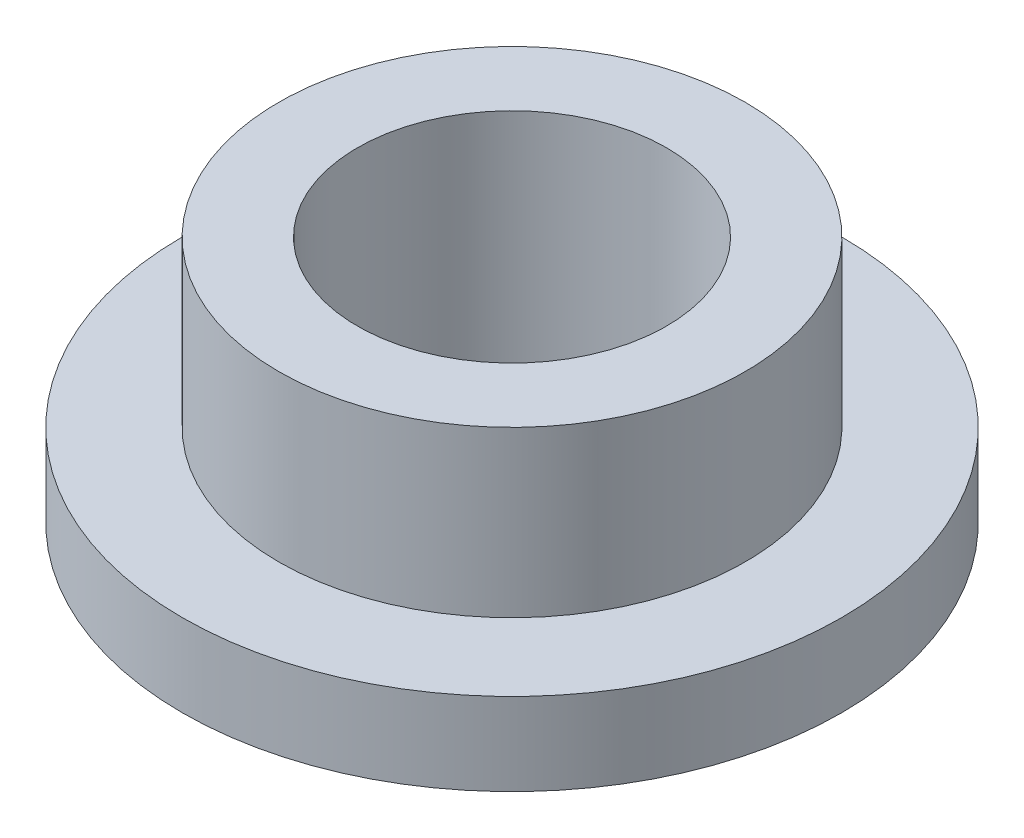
ISO-10303-21;
HEADER;
FILE_DESCRIPTION(('STEP AP214'),'2;1');
FILE_NAME('part.step','',(''),(''),'','','');
FILE_SCHEMA(('AUTOMOTIVE_DESIGN { 1 0 10303 214 1 1 1 1 }'));
ENDSEC;
DATA;
#1=APPLICATION_CONTEXT('core data for automotive mechanical design processes');
#2=APPLICATION_PROTOCOL_DEFINITION('international standard','automotive_design',2000,#1);
#3=PRODUCT_CONTEXT('',#1,'mechanical');
#4=PRODUCT('Part','Part','',(#3));
#5=PRODUCT_RELATED_PRODUCT_CATEGORY('part','',(#4));
#6=PRODUCT_DEFINITION_FORMATION('','',#4);
#7=PRODUCT_DEFINITION_CONTEXT('part definition',#1,'design');
#8=PRODUCT_DEFINITION('design','',#6,#7);
#9=PRODUCT_DEFINITION_SHAPE('','',#8);
#10=(LENGTH_UNIT() NAMED_UNIT(*) SI_UNIT(.MILLI.,.METRE.));
#11=(NAMED_UNIT(*) PLANE_ANGLE_UNIT() SI_UNIT($,.RADIAN.));
#12=(NAMED_UNIT(*) SI_UNIT($,.STERADIAN.) SOLID_ANGLE_UNIT());
#13=UNCERTAINTY_MEASURE_WITH_UNIT(LENGTH_MEASURE(1.E-05),#10,'distance_accuracy_value','');
#14=(GEOMETRIC_REPRESENTATION_CONTEXT(3) GLOBAL_UNCERTAINTY_ASSIGNED_CONTEXT((#13)) GLOBAL_UNIT_ASSIGNED_CONTEXT((#10,
#11,#12)) REPRESENTATION_CONTEXT('',''));
#15=CARTESIAN_POINT('',(0.,0.,0.));
#16=DIRECTION('',(0.,0.,1.));
#17=DIRECTION('',(1.,0.,0.));
#18=AXIS2_PLACEMENT_3D('',#15,#16,#17);
#19=CARTESIAN_POINT('',(0.,0.,0.));
#20=DIRECTION('',(0.,-1.,0.));
#21=DIRECTION('',(0.,0.,-1.));
#22=AXIS2_PLACEMENT_3D('',#19,#20,#21);
#23=CYLINDRICAL_SURFACE('',#22,5.08);
#24=CARTESIAN_POINT('',(0.,1.27,0.));
#25=DIRECTION('',(0.,-1.,0.));
#26=DIRECTION('',(0.,0.,-1.));
#27=AXIS2_PLACEMENT_3D('',#24,#25,#26);
#28=CIRCLE('',#27,5.08);
#29=CARTESIAN_POINT('',(0.,1.27,-5.08));
#30=VERTEX_POINT('',#29);
#31=EDGE_CURVE('E10',#30,#30,#28,.T.);
#32=ORIENTED_EDGE('',*,*,#31,.T.);
#33=EDGE_LOOP('',(#32));
#34=FACE_BOUND('',#33,.T.);
#35=CARTESIAN_POINT('',(0.,0.,0.));
#36=DIRECTION('',(0.,-1.,0.));
#37=DIRECTION('',(0.,0.,-1.));
#38=AXIS2_PLACEMENT_3D('',#35,#36,#37);
#39=CIRCLE('',#38,5.08);
#40=CARTESIAN_POINT('',(0.,0.,-5.08));
#41=VERTEX_POINT('',#40);
#42=EDGE_CURVE('E49',#41,#41,#39,.T.);
#43=ORIENTED_EDGE('',*,*,#42,.F.);
#44=EDGE_LOOP('',(#43));
#45=FACE_BOUND('',#44,.T.);
#46=ADVANCED_FACE('F27',(#34,#45),#23,.T.);
#47=CARTESIAN_POINT('',(5.08,1.27,0.));
#48=DIRECTION('',(0.,1.,0.));
#49=DIRECTION('',(0.,0.,1.));
#50=AXIS2_PLACEMENT_3D('',#47,#48,#49);
#51=PLANE('',#50);
#52=CARTESIAN_POINT('',(0.,1.27,0.));
#53=DIRECTION('',(0.,-1.,0.));
#54=DIRECTION('',(0.,0.,-1.));
#55=AXIS2_PLACEMENT_3D('',#52,#53,#54);
#56=CIRCLE('',#55,3.5941);
#57=CARTESIAN_POINT('',(0.,1.27,-3.5941));
#58=VERTEX_POINT('',#57);
#59=EDGE_CURVE('E33',#58,#58,#56,.T.);
#60=ORIENTED_EDGE('',*,*,#59,.T.);
#61=EDGE_LOOP('',(#60));
#62=FACE_BOUND('',#61,.T.);
#63=ORIENTED_EDGE('',*,*,#31,.F.);
#64=EDGE_LOOP('',(#63));
#65=FACE_BOUND('',#64,.T.);
#66=ADVANCED_FACE('F57',(#62,#65),#51,.T.);
#67=CARTESIAN_POINT('',(0.,0.,0.));
#68=DIRECTION('',(0.,-1.,0.));
#69=DIRECTION('',(0.,0.,-1.));
#70=AXIS2_PLACEMENT_3D('',#67,#68,#69);
#71=CYLINDRICAL_SURFACE('',#70,3.5941);
#72=CARTESIAN_POINT('',(0.,3.81,0.));
#73=DIRECTION('',(0.,-1.,0.));
#74=DIRECTION('',(0.,0.,-1.));
#75=AXIS2_PLACEMENT_3D('',#72,#73,#74);
#76=CIRCLE('',#75,3.5941);
#77=CARTESIAN_POINT('',(0.,3.81,-3.5941));
#78=VERTEX_POINT('',#77);
#79=EDGE_CURVE('E37',#78,#78,#76,.T.);
#80=ORIENTED_EDGE('',*,*,#79,.T.);
#81=EDGE_LOOP('',(#80));
#82=FACE_BOUND('',#81,.T.);
#83=ORIENTED_EDGE('',*,*,#59,.F.);
#84=EDGE_LOOP('',(#83));
#85=FACE_BOUND('',#84,.T.);
#86=ADVANCED_FACE('F61',(#82,#85),#71,.T.);
#87=CARTESIAN_POINT('',(3.5941,3.81,0.));
#88=DIRECTION('',(0.,1.,0.));
#89=DIRECTION('',(0.,0.,1.));
#90=AXIS2_PLACEMENT_3D('',#87,#88,#89);
#91=PLANE('',#90);
#92=CARTESIAN_POINT('',(0.,3.81,0.));
#93=DIRECTION('',(0.,-1.,0.));
#94=DIRECTION('',(0.,0.,-1.));
#95=AXIS2_PLACEMENT_3D('',#92,#93,#94);
#96=CIRCLE('',#95,2.38125);
#97=CARTESIAN_POINT('',(0.,3.81,-2.38125));
#98=VERTEX_POINT('',#97);
#99=EDGE_CURVE('E41',#98,#98,#96,.T.);
#100=ORIENTED_EDGE('',*,*,#99,.T.);
#101=EDGE_LOOP('',(#100));
#102=FACE_BOUND('',#101,.T.);
#103=ORIENTED_EDGE('',*,*,#79,.F.);
#104=EDGE_LOOP('',(#103));
#105=FACE_BOUND('',#104,.T.);
#106=ADVANCED_FACE('F65',(#102,#105),#91,.T.);
#107=CARTESIAN_POINT('',(0.,0.,0.));
#108=DIRECTION('',(0.,-1.,0.));
#109=DIRECTION('',(0.,0.,-1.));
#110=AXIS2_PLACEMENT_3D('',#107,#108,#109);
#111=CYLINDRICAL_SURFACE('',#110,2.38125);
#112=CARTESIAN_POINT('',(0.,0.,0.));
#113=DIRECTION('',(0.,-1.,0.));
#114=DIRECTION('',(0.,0.,-1.));
#115=AXIS2_PLACEMENT_3D('',#112,#113,#114);
#116=CIRCLE('',#115,2.38125);
#117=CARTESIAN_POINT('',(0.,0.,-2.38125));
#118=VERTEX_POINT('',#117);
#119=EDGE_CURVE('E46',#118,#118,#116,.T.);
#120=ORIENTED_EDGE('',*,*,#119,.T.);
#121=EDGE_LOOP('',(#120));
#122=FACE_BOUND('',#121,.T.);
#123=ORIENTED_EDGE('',*,*,#99,.F.);
#124=EDGE_LOOP('',(#123));
#125=FACE_BOUND('',#124,.T.);
#126=ADVANCED_FACE('F72',(#122,#125),#111,.F.);
#127=CARTESIAN_POINT('',(2.38125,0.,0.));
#128=DIRECTION('',(0.,-1.,0.));
#129=DIRECTION('',(0.,0.,-1.));
#130=AXIS2_PLACEMENT_3D('',#127,#128,#129);
#131=PLANE('',#130);
#132=ORIENTED_EDGE('',*,*,#42,.T.);
#133=EDGE_LOOP('',(#132));
#134=FACE_BOUND('',#133,.T.);
#135=ORIENTED_EDGE('',*,*,#119,.F.);
#136=EDGE_LOOP('',(#135));
#137=FACE_BOUND('',#136,.T.);
#138=ADVANCED_FACE('F53',(#134,#137),#131,.T.);
#139=CLOSED_SHELL('',(#46,#66,#86,#106,#126,#138));
#140=MANIFOLD_SOLID_BREP('B2',#139);
#141=ADVANCED_BREP_SHAPE_REPRESENTATION('',(#18,#140),#14);
#142=SHAPE_DEFINITION_REPRESENTATION(#9,#141);
ENDSEC;
END-ISO-10303-21;
